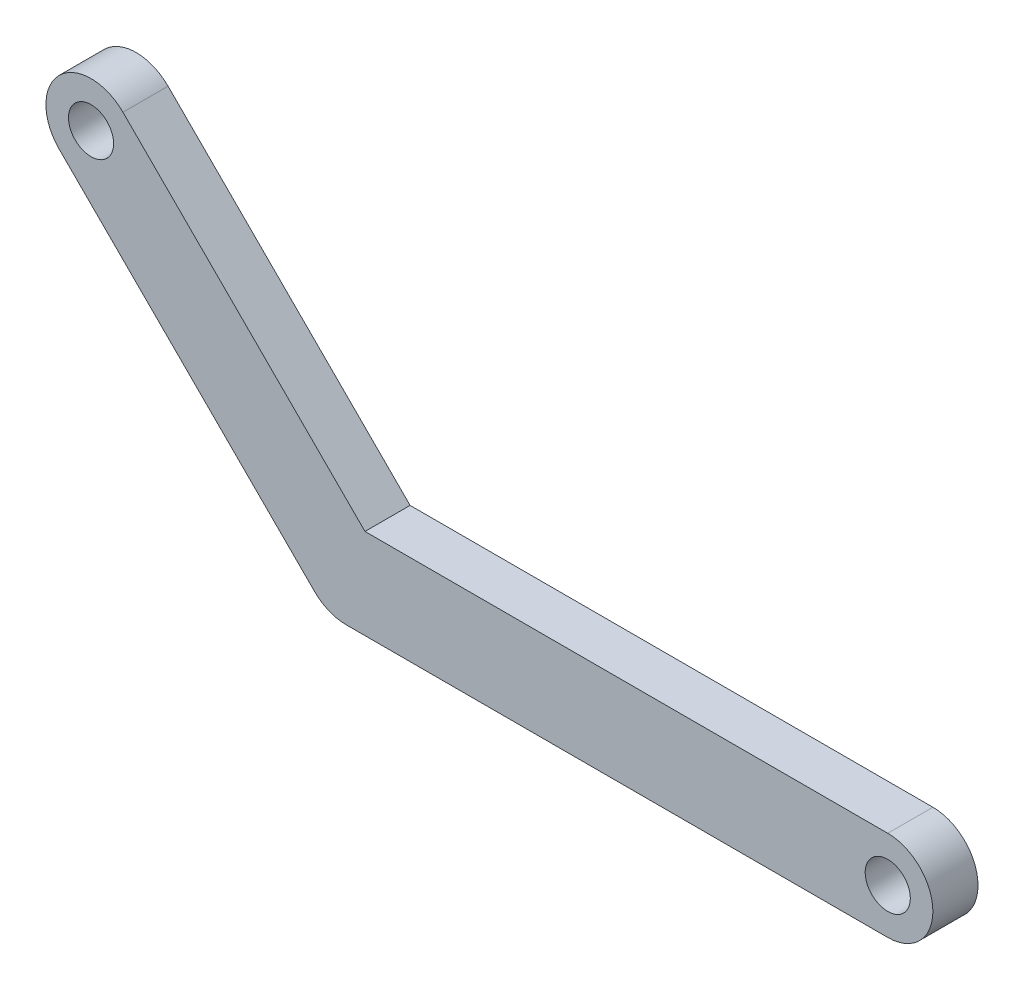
from build123d import *

# Parameters (mm, degrees)
SKETCH1_R           = 1.5875
BOSS_EXTRUDE1_DEPTH = 3.175
SKETCH2_R           = 1.5875
BOSS_EXTRUDE2_DEPTH = 3.175


with BuildPart() as part:
    # Sketch1 → Boss-Extrude1 (new body)
    with BuildSketch(Plane.XY):
        with BuildLine():
            Line((0, 3.175), (38.1, 3.175))
            ThreePointArc((38.1, 3.175), (41.275, 0), (38.1, -3.175))
            Line((38.1, -3.175), (0, -3.175))
            ThreePointArc((0, -3.175), (-3.175, 0), (0, 3.175))
        make_face()
        with Locations((38.1, 0)):
            Circle(SKETCH1_R, mode=Mode.SUBTRACT)
    extrude(amount=BOSS_EXTRUDE1_DEPTH)

    # Sketch2 → Boss-Extrude2 (add)
    with BuildSketch(Plane.XY):
        with BuildLine():
            Line((-2.24506403, -2.24506403), (-20.205576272, 15.715448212))
            ThreePointArc((-20.205576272, 15.715448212), (-20.205576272, 20.205576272), (-15.715448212, 20.205576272))
            Line((-15.715448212, 20.205576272), (2.24506403, 2.24506403))
            ThreePointArc((2.24506403, 2.24506403), (2.24506403, -2.24506403), (-2.24506403, -2.24506403))
        make_face()
        with Locations((-17.960512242, 17.960512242)):
            Circle(SKETCH2_R, mode=Mode.SUBTRACT)
    extrude(amount=BOSS_EXTRUDE2_DEPTH)


solid = part.part
